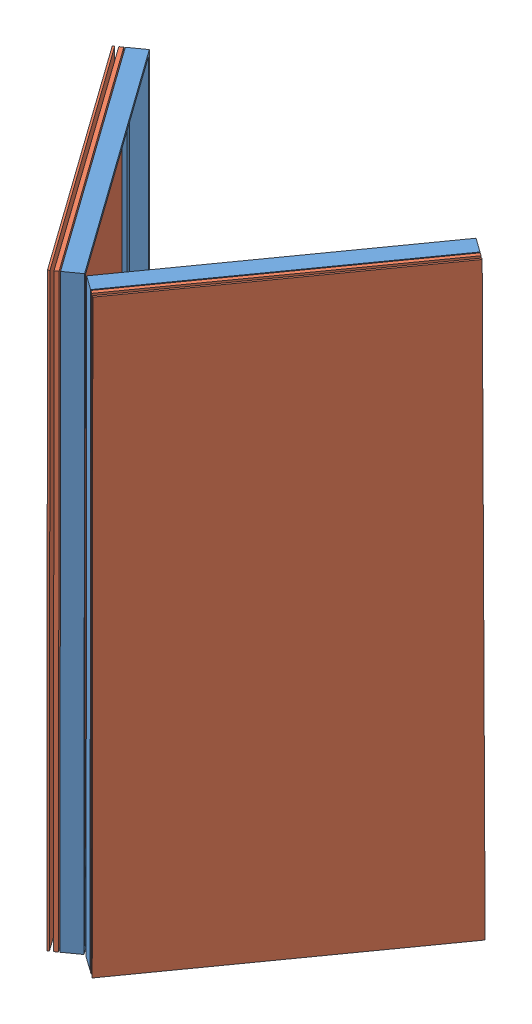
SolidWorks assembly Assem2.SLDASM, configuration Standard (file format 4400). Lengths in mm.
Overall size (12592.71 4309.05 4465.35).
6 component instances, 2 part files, 5 mates.
Components (placement in the parent):
- Assem1-1: Assem1.SLDASM [Standard] at (-71.4728 10.0216 63.377) x (0.581487 0.002154 0.813553) z (-0.764063 -0.342019 0.54702) size (3717.49 4041.67 1471.05)
  - Steelframe-1: Steelframe.SLDPRT [Standard] at origin size (1557 3086.49 1200.83)
  - Glass-1: Glass.sldprt [Default] at origin size (1557 3069.73 1154.79)
- Assem1-2: Assem1.SLDASM [Standard] at (1000.1193 9.1974 1330.0931) x (0.581476 0.000759 -0.813563) z (0.765776 -0.338187 0.547006) size (3717.49 4041.67 1471.05)
  - Steelframe-1: Steelframe.SLDPRT [Standard] at origin size (1557 3086.49 1200.83)
  - Glass-1: Glass.sldprt [Default] at origin size (1557 3069.73 1154.79)
Mates (geometry in assembly coordinates):
- LimitAngle2: limit planar angle = 1.900487 rad aligned: plane of ? through (-113.7776 10.0216 93.6144) normal (-0.813555 0 0.581489); plane of ? through (1042.4242 9.4093 1360.3298) normal (0.813555 0.004076 0.581474)
- Deckungsgleich1: coincident anti-aligned: line of ? through (0 3270 0) axis (0 -1 0)
- Deckungsgleich2: coincident anti-aligned: line of ? through (917.0304 3.3967 1283.0077) axis (-0.002505 0.999991 -0.003505); line of ? through (908.851 3268.7724 1271.564) axis (0.002505 -0.999991 0.003505)
- Deckungsgleich3: coincident: unknown of ?
- Deckungsgleich4: coincident = 2151.6059 mm: unknown of ?
